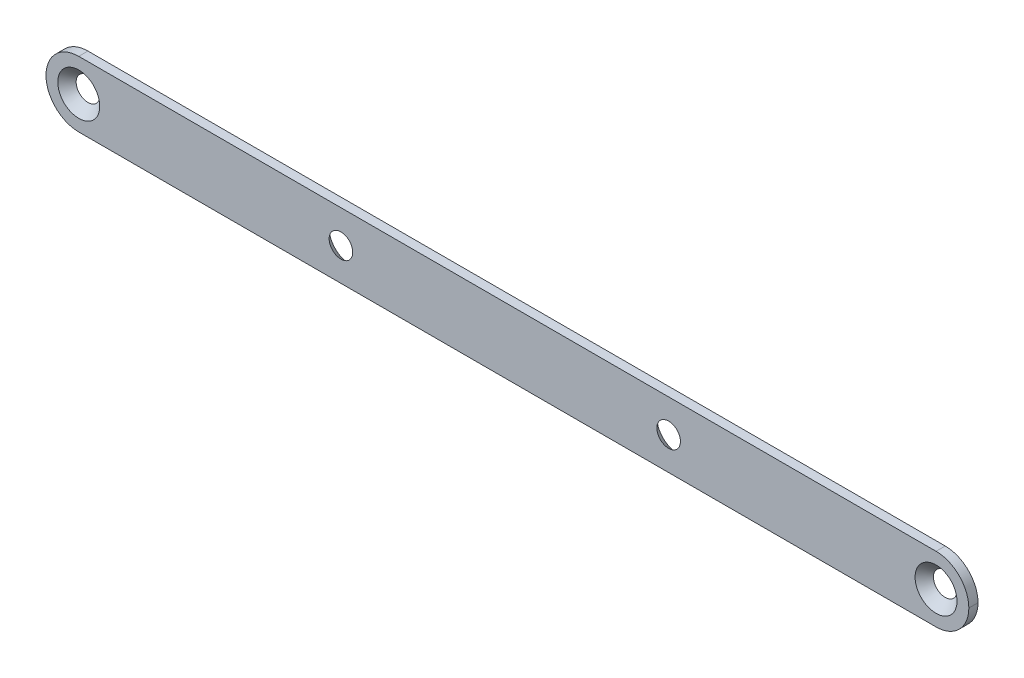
ISO-10303-21;
HEADER;
FILE_DESCRIPTION(('STEP AP214'),'2;1');
FILE_NAME('part.step','',(''),(''),'','','');
FILE_SCHEMA(('AUTOMOTIVE_DESIGN { 1 0 10303 214 1 1 1 1 }'));
ENDSEC;
DATA;
#1=APPLICATION_CONTEXT('core data for automotive mechanical design processes');
#2=APPLICATION_PROTOCOL_DEFINITION('international standard','automotive_design',2000,#1);
#3=PRODUCT_CONTEXT('',#1,'mechanical');
#4=PRODUCT('Part','Part','',(#3));
#5=PRODUCT_RELATED_PRODUCT_CATEGORY('part','',(#4));
#6=PRODUCT_DEFINITION_FORMATION('','',#4);
#7=PRODUCT_DEFINITION_CONTEXT('part definition',#1,'design');
#8=PRODUCT_DEFINITION('design','',#6,#7);
#9=PRODUCT_DEFINITION_SHAPE('','',#8);
#10=(LENGTH_UNIT() NAMED_UNIT(*) SI_UNIT(.MILLI.,.METRE.));
#11=(NAMED_UNIT(*) PLANE_ANGLE_UNIT() SI_UNIT($,.RADIAN.));
#12=(NAMED_UNIT(*) SI_UNIT($,.STERADIAN.) SOLID_ANGLE_UNIT());
#13=UNCERTAINTY_MEASURE_WITH_UNIT(LENGTH_MEASURE(1.E-05),#10,'distance_accuracy_value','');
#14=(GEOMETRIC_REPRESENTATION_CONTEXT(3) GLOBAL_UNCERTAINTY_ASSIGNED_CONTEXT((#13)) GLOBAL_UNIT_ASSIGNED_CONTEXT((#10,
#11,#12)) REPRESENTATION_CONTEXT('',''));
#15=CARTESIAN_POINT('',(0.,0.,0.));
#16=DIRECTION('',(0.,0.,1.));
#17=DIRECTION('',(1.,0.,0.));
#18=AXIS2_PLACEMENT_3D('',#15,#16,#17);
#19=CARTESIAN_POINT('',(0.,0.,0.));
#20=DIRECTION('',(0.,0.,1.));
#21=DIRECTION('',(1.,0.,0.));
#22=AXIS2_PLACEMENT_3D('',#19,#20,#21);
#23=PLANE('',#22);
#24=CARTESIAN_POINT('',(-16.9446198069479,0.357142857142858,0.));
#25=DIRECTION('',(0.,0.,1.));
#26=DIRECTION('',(1.,0.,0.));
#27=AXIS2_PLACEMENT_3D('',#24,#25,#26);
#28=CIRCLE('',#27,5.);
#29=CARTESIAN_POINT('',(-16.9446198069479,-4.64285714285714,0.));
#30=VERTEX_POINT('',#29);
#31=CARTESIAN_POINT('',(-21.9446198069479,0.35714285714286,0.));
#32=VERTEX_POINT('',#31);
#33=EDGE_CURVE('E90',#30,#32,#28,.F.);
#34=ORIENTED_EDGE('',*,*,#33,.T.);
#35=CARTESIAN_POINT('',(-16.9446198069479,0.357142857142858,0.));
#36=DIRECTION('',(0.,0.,1.));
#37=DIRECTION('',(1.,0.,0.));
#38=AXIS2_PLACEMENT_3D('',#35,#36,#37);
#39=CIRCLE('',#38,5.);
#40=CARTESIAN_POINT('',(-16.9446198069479,5.35714285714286,0.));
#41=VERTEX_POINT('',#40);
#42=EDGE_CURVE('E95',#32,#41,#39,.F.);
#43=ORIENTED_EDGE('',*,*,#42,.T.);
#44=DIRECTION('',(-1.,0.,0.));
#45=VECTOR('',#44,1.);
#46=CARTESIAN_POINT('',(-21.9446198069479,5.35714285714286,0.));
#47=LINE('',#46,#45);
#48=CARTESIAN_POINT('',(113.855380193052,5.35714285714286,0.));
#49=VERTEX_POINT('',#48);
#50=EDGE_CURVE('E133',#49,#41,#47,.T.);
#51=ORIENTED_EDGE('',*,*,#50,.F.);
#52=CARTESIAN_POINT('',(113.855380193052,0.357142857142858,0.));
#53=DIRECTION('',(0.,0.,1.));
#54=DIRECTION('',(1.,0.,0.));
#55=AXIS2_PLACEMENT_3D('',#52,#53,#54);
#56=CIRCLE('',#55,5.);
#57=CARTESIAN_POINT('',(118.855380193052,0.357142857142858,0.));
#58=VERTEX_POINT('',#57);
#59=EDGE_CURVE('E100',#49,#58,#56,.F.);
#60=ORIENTED_EDGE('',*,*,#59,.T.);
#61=CARTESIAN_POINT('',(113.855380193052,0.357142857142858,0.));
#62=DIRECTION('',(0.,0.,1.));
#63=DIRECTION('',(1.,0.,0.));
#64=AXIS2_PLACEMENT_3D('',#61,#62,#63);
#65=CIRCLE('',#64,5.);
#66=CARTESIAN_POINT('',(113.855380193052,-4.64285714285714,0.));
#67=VERTEX_POINT('',#66);
#68=EDGE_CURVE('E145',#58,#67,#65,.F.);
#69=ORIENTED_EDGE('',*,*,#68,.T.);
#70=DIRECTION('',(1.,0.,0.));
#71=VECTOR('',#70,1.);
#72=CARTESIAN_POINT('',(-21.9446198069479,-4.64285714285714,0.));
#73=LINE('',#72,#71);
#74=EDGE_CURVE('E97',#30,#67,#73,.T.);
#75=ORIENTED_EDGE('',*,*,#74,.F.);
#76=EDGE_LOOP('',(#34,#43,#51,#60,#69,#75));
#77=FACE_BOUND('',#76,.T.);
#78=CARTESIAN_POINT('',(113.855380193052,0.357142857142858,0.));
#79=DIRECTION('',(0.,0.,1.));
#80=DIRECTION('',(1.,0.,0.));
#81=AXIS2_PLACEMENT_3D('',#78,#79,#80);
#82=CIRCLE('',#81,1.79999999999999);
#83=CARTESIAN_POINT('',(115.655380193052,0.357142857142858,0.));
#84=VERTEX_POINT('',#83);
#85=EDGE_CURVE('E137',#84,#84,#82,.T.);
#86=ORIENTED_EDGE('',*,*,#85,.T.);
#87=EDGE_LOOP('',(#86));
#88=FACE_BOUND('',#87,.T.);
#89=CARTESIAN_POINT('',(-16.9446198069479,0.357142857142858,0.));
#90=DIRECTION('',(0.,0.,1.));
#91=DIRECTION('',(1.,0.,0.));
#92=AXIS2_PLACEMENT_3D('',#89,#90,#91);
#93=CIRCLE('',#92,1.8);
#94=CARTESIAN_POINT('',(-15.1446198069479,0.357142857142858,0.));
#95=VERTEX_POINT('',#94);
#96=EDGE_CURVE('E202',#95,#95,#93,.T.);
#97=ORIENTED_EDGE('',*,*,#96,.T.);
#98=EDGE_LOOP('',(#97));
#99=FACE_BOUND('',#98,.T.);
#100=CARTESIAN_POINT('',(23.0553801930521,0.357142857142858,0.));
#101=DIRECTION('',(0.,0.,-1.));
#102=DIRECTION('',(-1.,0.,0.));
#103=AXIS2_PLACEMENT_3D('',#100,#101,#102);
#104=CIRCLE('',#103,3.2);
#105=CARTESIAN_POINT('',(19.8553801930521,0.357142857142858,0.));
#106=VERTEX_POINT('',#105);
#107=EDGE_CURVE('E144',#106,#106,#104,.T.);
#108=ORIENTED_EDGE('',*,*,#107,.F.);
#109=EDGE_LOOP('',(#108));
#110=FACE_BOUND('',#109,.T.);
#111=CARTESIAN_POINT('',(73.0553801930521,0.357142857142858,0.));
#112=DIRECTION('',(0.,0.,-1.));
#113=DIRECTION('',(-1.,0.,0.));
#114=AXIS2_PLACEMENT_3D('',#111,#112,#113);
#115=CIRCLE('',#114,3.19999999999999);
#116=CARTESIAN_POINT('',(69.8553801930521,0.357142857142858,0.));
#117=VERTEX_POINT('',#116);
#118=EDGE_CURVE('E108',#117,#117,#115,.T.);
#119=ORIENTED_EDGE('',*,*,#118,.F.);
#120=EDGE_LOOP('',(#119));
#121=FACE_BOUND('',#120,.T.);
#122=ADVANCED_FACE('F35',(#77,#88,#99,#110,#121),#23,.F.);
#123=CARTESIAN_POINT('',(0.,0.,1.4));
#124=DIRECTION('',(0.,0.,1.));
#125=DIRECTION('',(1.,0.,0.));
#126=AXIS2_PLACEMENT_3D('',#123,#124,#125);
#127=PLANE('',#126);
#128=CARTESIAN_POINT('',(73.0553801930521,0.357142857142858,1.4));
#129=DIRECTION('',(0.,0.,1.));
#130=DIRECTION('',(1.,0.,0.));
#131=AXIS2_PLACEMENT_3D('',#128,#129,#130);
#132=CIRCLE('',#131,1.79999999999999);
#133=CARTESIAN_POINT('',(74.8553801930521,0.357142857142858,1.4));
#134=VERTEX_POINT('',#133);
#135=EDGE_CURVE('E141',#134,#134,#132,.T.);
#136=ORIENTED_EDGE('',*,*,#135,.F.);
#137=EDGE_LOOP('',(#136));
#138=FACE_BOUND('',#137,.T.);
#139=CARTESIAN_POINT('',(23.0553801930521,0.357142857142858,1.4));
#140=DIRECTION('',(0.,0.,1.));
#141=DIRECTION('',(1.,0.,0.));
#142=AXIS2_PLACEMENT_3D('',#139,#140,#141);
#143=CIRCLE('',#142,1.8);
#144=CARTESIAN_POINT('',(24.8553801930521,0.357142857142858,1.4));
#145=VERTEX_POINT('',#144);
#146=EDGE_CURVE('E210',#145,#145,#143,.T.);
#147=ORIENTED_EDGE('',*,*,#146,.F.);
#148=EDGE_LOOP('',(#147));
#149=FACE_BOUND('',#148,.T.);
#150=CARTESIAN_POINT('',(-16.9446198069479,0.357142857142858,1.4));
#151=DIRECTION('',(0.,0.,1.));
#152=DIRECTION('',(1.,0.,0.));
#153=AXIS2_PLACEMENT_3D('',#150,#151,#152);
#154=CIRCLE('',#153,3.2);
#155=CARTESIAN_POINT('',(-13.7446198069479,0.357142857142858,1.4));
#156=VERTEX_POINT('',#155);
#157=EDGE_CURVE('E207',#156,#156,#154,.T.);
#158=ORIENTED_EDGE('',*,*,#157,.F.);
#159=EDGE_LOOP('',(#158));
#160=FACE_BOUND('',#159,.T.);
#161=CARTESIAN_POINT('',(113.855380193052,0.357142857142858,1.4));
#162=DIRECTION('',(0.,0.,1.));
#163=DIRECTION('',(1.,0.,0.));
#164=AXIS2_PLACEMENT_3D('',#161,#162,#163);
#165=CIRCLE('',#164,3.19999999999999);
#166=CARTESIAN_POINT('',(117.055380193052,0.357142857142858,1.4));
#167=VERTEX_POINT('',#166);
#168=EDGE_CURVE('E198',#167,#167,#165,.T.);
#169=ORIENTED_EDGE('',*,*,#168,.F.);
#170=EDGE_LOOP('',(#169));
#171=FACE_BOUND('',#170,.T.);
#172=DIRECTION('',(-1.,0.,0.));
#173=VECTOR('',#172,1.);
#174=CARTESIAN_POINT('',(-21.9446198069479,5.35714285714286,1.4));
#175=LINE('',#174,#173);
#176=CARTESIAN_POINT('',(113.855380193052,5.35714285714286,1.4));
#177=VERTEX_POINT('',#176);
#178=CARTESIAN_POINT('',(-16.9446198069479,5.35714285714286,1.4));
#179=VERTEX_POINT('',#178);
#180=EDGE_CURVE('E129',#177,#179,#175,.T.);
#181=ORIENTED_EDGE('',*,*,#180,.T.);
#182=CARTESIAN_POINT('',(-16.9446198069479,0.357142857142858,1.4));
#183=DIRECTION('',(0.,0.,1.));
#184=DIRECTION('',(1.,0.,0.));
#185=AXIS2_PLACEMENT_3D('',#182,#183,#184);
#186=CIRCLE('',#185,5.);
#187=CARTESIAN_POINT('',(-21.9446198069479,0.35714285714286,1.4));
#188=VERTEX_POINT('',#187);
#189=EDGE_CURVE('E124',#179,#188,#186,.T.);
#190=ORIENTED_EDGE('',*,*,#189,.T.);
#191=CARTESIAN_POINT('',(-16.9446198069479,0.357142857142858,1.4));
#192=DIRECTION('',(0.,0.,1.));
#193=DIRECTION('',(1.,0.,0.));
#194=AXIS2_PLACEMENT_3D('',#191,#192,#193);
#195=CIRCLE('',#194,5.);
#196=CARTESIAN_POINT('',(-16.9446198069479,-4.64285714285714,1.4));
#197=VERTEX_POINT('',#196);
#198=EDGE_CURVE('E106',#188,#197,#195,.T.);
#199=ORIENTED_EDGE('',*,*,#198,.T.);
#200=DIRECTION('',(1.,0.,0.));
#201=VECTOR('',#200,1.);
#202=CARTESIAN_POINT('',(-21.9446198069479,-4.64285714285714,1.4));
#203=LINE('',#202,#201);
#204=CARTESIAN_POINT('',(113.855380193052,-4.64285714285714,1.4));
#205=VERTEX_POINT('',#204);
#206=EDGE_CURVE('E134',#197,#205,#203,.T.);
#207=ORIENTED_EDGE('',*,*,#206,.T.);
#208=CARTESIAN_POINT('',(113.855380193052,0.357142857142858,1.4));
#209=DIRECTION('',(0.,0.,1.));
#210=DIRECTION('',(1.,0.,0.));
#211=AXIS2_PLACEMENT_3D('',#208,#209,#210);
#212=CIRCLE('',#211,5.);
#213=CARTESIAN_POINT('',(118.855380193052,0.357142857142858,1.4));
#214=VERTEX_POINT('',#213);
#215=EDGE_CURVE('E52',#205,#214,#212,.T.);
#216=ORIENTED_EDGE('',*,*,#215,.T.);
#217=CARTESIAN_POINT('',(113.855380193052,0.357142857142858,1.4));
#218=DIRECTION('',(0.,0.,1.));
#219=DIRECTION('',(1.,0.,0.));
#220=AXIS2_PLACEMENT_3D('',#217,#218,#219);
#221=CIRCLE('',#220,5.);
#222=EDGE_CURVE('E121',#214,#177,#221,.T.);
#223=ORIENTED_EDGE('',*,*,#222,.T.);
#224=EDGE_LOOP('',(#181,#190,#199,#207,#216,#223));
#225=FACE_BOUND('',#224,.T.);
#226=ADVANCED_FACE('F127',(#138,#149,#160,#171,#225),#127,.T.);
#227=CARTESIAN_POINT('',(-21.9446198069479,-4.64285714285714,1.4));
#228=DIRECTION('',(0.,1.,0.));
#229=DIRECTION('',(0.,0.,1.));
#230=AXIS2_PLACEMENT_3D('',#227,#228,#229);
#231=PLANE('',#230);
#232=ORIENTED_EDGE('',*,*,#206,.F.);
#233=DIRECTION('',(0.,0.,-1.));
#234=VECTOR('',#233,1.);
#235=CARTESIAN_POINT('',(-16.9446198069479,-4.64285714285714,1.4));
#236=LINE('',#235,#234);
#237=EDGE_CURVE('E11',#197,#30,#236,.T.);
#238=ORIENTED_EDGE('',*,*,#237,.T.);
#239=ORIENTED_EDGE('',*,*,#74,.T.);
#240=DIRECTION('',(0.,0.,-1.));
#241=VECTOR('',#240,1.);
#242=CARTESIAN_POINT('',(113.855380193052,-4.64285714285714,1.4));
#243=LINE('',#242,#241);
#244=EDGE_CURVE('E44',#67,#205,#243,.F.);
#245=ORIENTED_EDGE('',*,*,#244,.T.);
#246=EDGE_LOOP('',(#232,#238,#239,#245));
#247=FACE_BOUND('',#246,.T.);
#248=ADVANCED_FACE('F162',(#247),#231,.F.);
#249=CARTESIAN_POINT('',(-21.9446198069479,5.35714285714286,1.4));
#250=DIRECTION('',(0.,-1.,0.));
#251=DIRECTION('',(0.,0.,-1.));
#252=AXIS2_PLACEMENT_3D('',#249,#250,#251);
#253=PLANE('',#252);
#254=ORIENTED_EDGE('',*,*,#50,.T.);
#255=DIRECTION('',(0.,0.,-1.));
#256=VECTOR('',#255,1.);
#257=CARTESIAN_POINT('',(-16.9446198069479,5.35714285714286,1.4));
#258=LINE('',#257,#256);
#259=EDGE_CURVE('E112',#41,#179,#258,.F.);
#260=ORIENTED_EDGE('',*,*,#259,.T.);
#261=ORIENTED_EDGE('',*,*,#180,.F.);
#262=DIRECTION('',(0.,0.,-1.));
#263=VECTOR('',#262,1.);
#264=CARTESIAN_POINT('',(113.855380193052,5.35714285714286,1.4));
#265=LINE('',#264,#263);
#266=EDGE_CURVE('E113',#177,#49,#265,.T.);
#267=ORIENTED_EDGE('',*,*,#266,.T.);
#268=EDGE_LOOP('',(#254,#260,#261,#267));
#269=FACE_BOUND('',#268,.T.);
#270=ADVANCED_FACE('F131',(#269),#253,.F.);
#271=CARTESIAN_POINT('',(113.855380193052,0.357142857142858,1.4));
#272=DIRECTION('',(0.,0.,1.));
#273=DIRECTION('',(1.,0.,0.));
#274=AXIS2_PLACEMENT_3D('',#271,#272,#273);
#275=CONICAL_SURFACE('',#274,3.19999999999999,0.785398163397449);
#276=ORIENTED_EDGE('',*,*,#168,.T.);
#277=EDGE_LOOP('',(#276));
#278=FACE_BOUND('',#277,.T.);
#279=ORIENTED_EDGE('',*,*,#85,.F.);
#280=EDGE_LOOP('',(#279));
#281=FACE_BOUND('',#280,.T.);
#282=ADVANCED_FACE('F169',(#278,#281),#275,.F.);
#283=CARTESIAN_POINT('',(-16.9446198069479,0.357142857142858,1.4));
#284=DIRECTION('',(0.,0.,1.));
#285=DIRECTION('',(1.,0.,0.));
#286=AXIS2_PLACEMENT_3D('',#283,#284,#285);
#287=CONICAL_SURFACE('',#286,3.2,0.785398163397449);
#288=ORIENTED_EDGE('',*,*,#157,.T.);
#289=EDGE_LOOP('',(#288));
#290=FACE_BOUND('',#289,.T.);
#291=ORIENTED_EDGE('',*,*,#96,.F.);
#292=EDGE_LOOP('',(#291));
#293=FACE_BOUND('',#292,.T.);
#294=ADVANCED_FACE('F184',(#290,#293),#287,.F.);
#295=CARTESIAN_POINT('',(23.0553801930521,0.357142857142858,0.));
#296=DIRECTION('',(0.,0.,-1.));
#297=DIRECTION('',(-1.,0.,0.));
#298=AXIS2_PLACEMENT_3D('',#295,#296,#297);
#299=CONICAL_SURFACE('',#298,3.2,0.78539816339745);
#300=ORIENTED_EDGE('',*,*,#146,.T.);
#301=EDGE_LOOP('',(#300));
#302=FACE_BOUND('',#301,.T.);
#303=ORIENTED_EDGE('',*,*,#107,.T.);
#304=EDGE_LOOP('',(#303));
#305=FACE_BOUND('',#304,.T.);
#306=ADVANCED_FACE('F178',(#302,#305),#299,.F.);
#307=CARTESIAN_POINT('',(73.0553801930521,0.357142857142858,0.));
#308=DIRECTION('',(0.,0.,-1.));
#309=DIRECTION('',(-1.,0.,0.));
#310=AXIS2_PLACEMENT_3D('',#307,#308,#309);
#311=CONICAL_SURFACE('',#310,3.19999999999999,0.785398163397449);
#312=ORIENTED_EDGE('',*,*,#135,.T.);
#313=EDGE_LOOP('',(#312));
#314=FACE_BOUND('',#313,.T.);
#315=ORIENTED_EDGE('',*,*,#118,.T.);
#316=EDGE_LOOP('',(#315));
#317=FACE_BOUND('',#316,.T.);
#318=ADVANCED_FACE('F174',(#314,#317),#311,.F.);
#319=CARTESIAN_POINT('',(-16.9446198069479,0.357142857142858,1.4));
#320=DIRECTION('',(0.,0.,-1.));
#321=DIRECTION('',(-1.,0.,0.));
#322=AXIS2_PLACEMENT_3D('',#319,#320,#321);
#323=CYLINDRICAL_SURFACE('',#322,5.);
#324=ORIENTED_EDGE('',*,*,#237,.F.);
#325=ORIENTED_EDGE('',*,*,#198,.F.);
#326=DIRECTION('',(0.,0.,-1.));
#327=VECTOR('',#326,1.);
#328=CARTESIAN_POINT('',(-21.9446198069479,0.35714285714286,1.4));
#329=LINE('',#328,#327);
#330=EDGE_CURVE('E104',#32,#188,#329,.F.);
#331=ORIENTED_EDGE('',*,*,#330,.F.);
#332=ORIENTED_EDGE('',*,*,#33,.F.);
#333=EDGE_LOOP('',(#324,#325,#331,#332));
#334=FACE_BOUND('',#333,.T.);
#335=ADVANCED_FACE('F105',(#334),#323,.T.);
#336=CARTESIAN_POINT('',(-16.9446198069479,0.357142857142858,1.4));
#337=DIRECTION('',(0.,0.,-1.));
#338=DIRECTION('',(-1.,0.,0.));
#339=AXIS2_PLACEMENT_3D('',#336,#337,#338);
#340=CYLINDRICAL_SURFACE('',#339,5.);
#341=ORIENTED_EDGE('',*,*,#189,.F.);
#342=ORIENTED_EDGE('',*,*,#259,.F.);
#343=ORIENTED_EDGE('',*,*,#42,.F.);
#344=ORIENTED_EDGE('',*,*,#330,.T.);
#345=EDGE_LOOP('',(#341,#342,#343,#344));
#346=FACE_BOUND('',#345,.T.);
#347=ADVANCED_FACE('F110',(#346),#340,.T.);
#348=CARTESIAN_POINT('',(113.855380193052,0.357142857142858,1.4));
#349=DIRECTION('',(0.,0.,-1.));
#350=DIRECTION('',(-1.,0.,0.));
#351=AXIS2_PLACEMENT_3D('',#348,#349,#350);
#352=CYLINDRICAL_SURFACE('',#351,5.);
#353=DIRECTION('',(0.,0.,-1.));
#354=VECTOR('',#353,1.);
#355=CARTESIAN_POINT('',(118.855380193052,0.357142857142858,1.4));
#356=LINE('',#355,#354);
#357=EDGE_CURVE('E39',#214,#58,#356,.T.);
#358=ORIENTED_EDGE('',*,*,#357,.F.);
#359=ORIENTED_EDGE('',*,*,#215,.F.);
#360=ORIENTED_EDGE('',*,*,#244,.F.);
#361=ORIENTED_EDGE('',*,*,#68,.F.);
#362=EDGE_LOOP('',(#358,#359,#360,#361));
#363=FACE_BOUND('',#362,.T.);
#364=ADVANCED_FACE('F37',(#363),#352,.T.);
#365=CARTESIAN_POINT('',(113.855380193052,0.357142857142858,1.4));
#366=DIRECTION('',(0.,0.,-1.));
#367=DIRECTION('',(-1.,0.,0.));
#368=AXIS2_PLACEMENT_3D('',#365,#366,#367);
#369=CYLINDRICAL_SURFACE('',#368,5.);
#370=ORIENTED_EDGE('',*,*,#222,.F.);
#371=ORIENTED_EDGE('',*,*,#357,.T.);
#372=ORIENTED_EDGE('',*,*,#59,.F.);
#373=ORIENTED_EDGE('',*,*,#266,.F.);
#374=EDGE_LOOP('',(#370,#371,#372,#373));
#375=FACE_BOUND('',#374,.T.);
#376=ADVANCED_FACE('F151',(#375),#369,.T.);
#377=CLOSED_SHELL('',(#122,#226,#248,#270,#282,#294,#306,#318,#335,#347,#364,#376));
#378=MANIFOLD_SOLID_BREP('B2',#377);
#379=ADVANCED_BREP_SHAPE_REPRESENTATION('',(#18,#378),#14);
#380=SHAPE_DEFINITION_REPRESENTATION(#9,#379);
ENDSEC;
END-ISO-10303-21;
